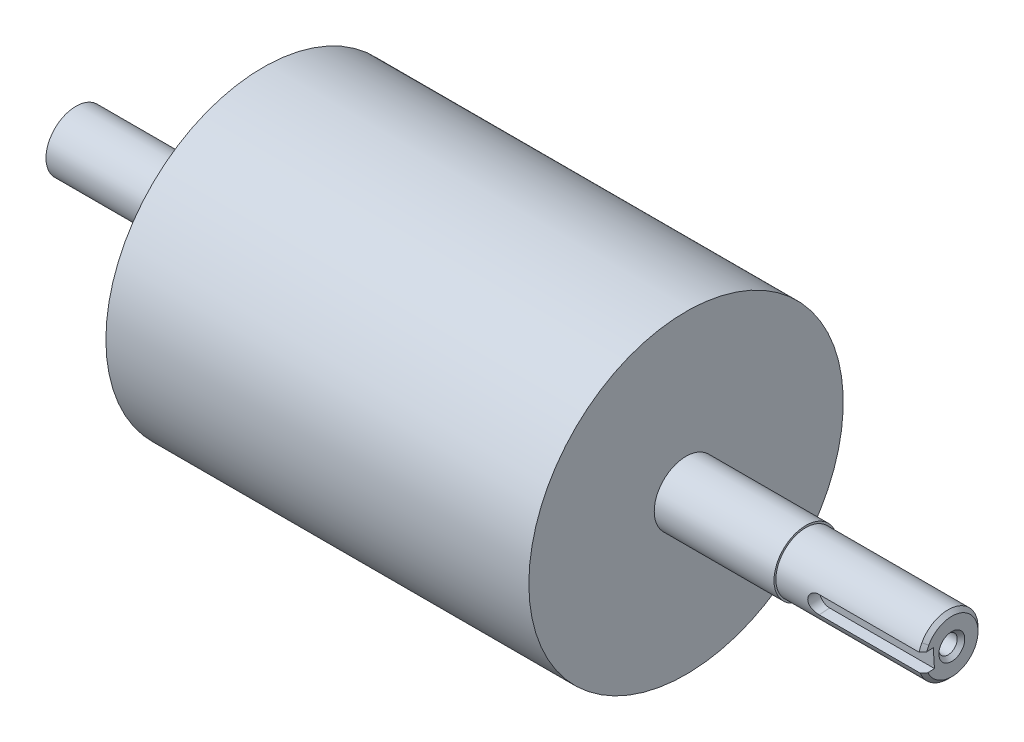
ISO-10303-21;
HEADER;
FILE_DESCRIPTION(('STEP AP214'),'2;1');
FILE_NAME('part.step','',(''),(''),'','','');
FILE_SCHEMA(('AUTOMOTIVE_DESIGN { 1 0 10303 214 1 1 1 1 }'));
ENDSEC;
DATA;
#1=APPLICATION_CONTEXT('core data for automotive mechanical design processes');
#2=APPLICATION_PROTOCOL_DEFINITION('international standard','automotive_design',2000,#1);
#3=PRODUCT_CONTEXT('',#1,'mechanical');
#4=PRODUCT('Part','Part','',(#3));
#5=PRODUCT_RELATED_PRODUCT_CATEGORY('part','',(#4));
#6=PRODUCT_DEFINITION_FORMATION('','',#4);
#7=PRODUCT_DEFINITION_CONTEXT('part definition',#1,'design');
#8=PRODUCT_DEFINITION('design','',#6,#7);
#9=PRODUCT_DEFINITION_SHAPE('','',#8);
#10=(LENGTH_UNIT() NAMED_UNIT(*) SI_UNIT(.MILLI.,.METRE.));
#11=(NAMED_UNIT(*) PLANE_ANGLE_UNIT() SI_UNIT($,.RADIAN.));
#12=(NAMED_UNIT(*) SI_UNIT($,.STERADIAN.) SOLID_ANGLE_UNIT());
#13=UNCERTAINTY_MEASURE_WITH_UNIT(LENGTH_MEASURE(1.E-05),#10,'distance_accuracy_value','');
#14=(GEOMETRIC_REPRESENTATION_CONTEXT(3) GLOBAL_UNCERTAINTY_ASSIGNED_CONTEXT((#13)) GLOBAL_UNIT_ASSIGNED_CONTEXT((#10,
#11,#12)) REPRESENTATION_CONTEXT('',''));
#15=CARTESIAN_POINT('',(0.,0.,0.));
#16=DIRECTION('',(0.,0.,1.));
#17=DIRECTION('',(1.,0.,0.));
#18=AXIS2_PLACEMENT_3D('',#15,#16,#17);
#19=CARTESIAN_POINT('',(-22.000000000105,0.,0.));
#20=DIRECTION('',(1.,0.,0.));
#21=DIRECTION('',(0.,0.,-1.));
#22=AXIS2_PLACEMENT_3D('',#19,#20,#21);
#23=CONICAL_SURFACE('',#22,2.45849999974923,1.04719755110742);
#24=CARTESIAN_POINT('',(-22.,0.,0.));
#25=DIRECTION('',(-1.,0.,0.));
#26=DIRECTION('',(0.,0.,1.));
#27=AXIS2_PLACEMENT_3D('',#24,#25,#26);
#28=CIRCLE('',#27,2.4585);
#29=CARTESIAN_POINT('',(-22.,0.,2.4585));
#30=VERTEX_POINT('',#29);
#31=EDGE_CURVE('E157',#30,#30,#28,.F.);
#32=ORIENTED_EDGE('',*,*,#31,.T.);
#33=EDGE_LOOP('',(#32));
#34=FACE_BOUND('',#33,.T.);
#35=CARTESIAN_POINT('',(-23.4194156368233,2.84216947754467E-11,-2.84217240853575E-11));
#36=VERTEX_POINT('',#35);
#37=VERTEX_LOOP('',#36);
#38=FACE_BOUND('',#37,.T.);
#39=ADVANCED_FACE('F16',(#34,#38),#23,.F.);
#40=CARTESIAN_POINT('',(-0.1,0.,0.));
#41=DIRECTION('',(-1.,0.,0.));
#42=DIRECTION('',(0.,0.,1.));
#43=AXIS2_PLACEMENT_3D('',#40,#41,#42);
#44=CYLINDRICAL_SURFACE('',#43,2.4585);
#45=CARTESIAN_POINT('',(-0.999999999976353,0.,0.));
#46=DIRECTION('',(1.,0.,0.));
#47=DIRECTION('',(0.,0.87758256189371,-0.479425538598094));
#48=AXIS2_PLACEMENT_3D('',#45,#46,#47);
#49=CIRCLE('',#48,2.45850000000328);
#50=CARTESIAN_POINT('',(-0.999999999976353,2.15753672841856,-1.17866768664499));
#51=VERTEX_POINT('',#50);
#52=EDGE_CURVE('E143',#51,#51,#49,.T.);
#53=ORIENTED_EDGE('',*,*,#52,.T.);
#54=EDGE_LOOP('',(#53));
#55=FACE_BOUND('',#54,.T.);
#56=ORIENTED_EDGE('',*,*,#31,.F.);
#57=EDGE_LOOP('',(#56));
#58=FACE_BOUND('',#57,.T.);
#59=ADVANCED_FACE('F291',(#55,#58),#44,.F.);
#60=CARTESIAN_POINT('',(-1.13686837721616E-10,0.,0.));
#61=DIRECTION('',(1.,0.,0.));
#62=DIRECTION('',(0.,0.,-1.));
#63=AXIS2_PLACEMENT_3D('',#60,#61,#62);
#64=CONICAL_SURFACE('',#63,3.45849999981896,0.785398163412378);
#65=ORIENTED_EDGE('',*,*,#52,.F.);
#66=EDGE_LOOP('',(#65));
#67=FACE_BOUND('',#66,.T.);
#68=CARTESIAN_POINT('',(7.68460815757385E-11,0.,0.));
#69=DIRECTION('',(1.,0.,0.));
#70=DIRECTION('',(0.,0.,-1.));
#71=AXIS2_PLACEMENT_3D('',#68,#69,#70);
#72=CIRCLE('',#71,3.45850000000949);
#73=CARTESIAN_POINT('',(7.68460815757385E-11,0.,-3.45850000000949));
#74=VERTEX_POINT('',#73);
#75=EDGE_CURVE('E84',#74,#74,#72,.T.);
#76=ORIENTED_EDGE('',*,*,#75,.T.);
#77=EDGE_LOOP('',(#76));
#78=FACE_BOUND('',#77,.T.);
#79=ADVANCED_FACE('F280',(#67,#78),#64,.F.);
#80=CARTESIAN_POINT('',(0.,-0.29289491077,4.7910554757));
#81=DIRECTION('',(0.,0.0610197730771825,-0.998136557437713));
#82=DIRECTION('',(0.,0.998136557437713,0.0610197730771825));
#83=AXIS2_PLACEMENT_3D('',#80,#81,#82);
#84=PLANE('',#83);
#85=DIRECTION('',(1.,0.,0.));
#86=VECTOR('',#85,1.);
#87=CARTESIAN_POINT('',(0.,2.20244648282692,4.94360490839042));
#88=LINE('',#87,#86);
#89=CARTESIAN_POINT('',(-28.,2.20244648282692,4.94360490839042));
#90=VERTEX_POINT('',#89);
#91=CARTESIAN_POINT('',(0.,2.20244648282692,4.94360490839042));
#92=VERTEX_POINT('',#91);
#93=EDGE_CURVE('E98',#90,#92,#88,.T.);
#94=ORIENTED_EDGE('',*,*,#93,.F.);
#95=CARTESIAN_POINT('',(-28.,-0.292894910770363,4.79105547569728));
#96=DIRECTION('',(0.,0.0610197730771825,-0.998136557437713));
#97=DIRECTION('',(0.,0.998136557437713,0.0610197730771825));
#98=AXIS2_PLACEMENT_3D('',#95,#96,#97);
#99=CIRCLE('',#98,2.5);
#100=CARTESIAN_POINT('',(-28.,-2.78823630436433,4.63850604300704));
#101=VERTEX_POINT('',#100);
#102=EDGE_CURVE('E114',#90,#101,#99,.F.);
#103=ORIENTED_EDGE('',*,*,#102,.T.);
#104=DIRECTION('',(1.,0.,0.));
#105=VECTOR('',#104,1.);
#106=CARTESIAN_POINT('',(-28.,-2.78823630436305,4.63850604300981));
#107=LINE('',#106,#105);
#108=CARTESIAN_POINT('',(0.,-2.78823630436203,4.63850604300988));
#109=VERTEX_POINT('',#108);
#110=EDGE_CURVE('E118',#109,#101,#107,.F.);
#111=ORIENTED_EDGE('',*,*,#110,.F.);
#112=DIRECTION('',(0.,0.998136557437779,0.0610197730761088));
#113=VECTOR('',#112,1.);
#114=CARTESIAN_POINT('',(0.,-2.78823630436,4.63850604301));
#115=LINE('',#114,#113);
#116=EDGE_CURVE('E85',#109,#92,#115,.T.);
#117=ORIENTED_EDGE('',*,*,#116,.T.);
#118=EDGE_LOOP('',(#94,#103,#111,#117));
#119=FACE_BOUND('',#118,.T.);
#120=ADVANCED_FACE('F271',(#119),#84,.F.);
#121=CARTESIAN_POINT('',(0.,0.,0.));
#122=DIRECTION('',(-1.,0.,0.));
#123=DIRECTION('',(0.,0.,1.));
#124=AXIS2_PLACEMENT_3D('',#121,#122,#123);
#125=PLANE('',#124);
#126=ORIENTED_EDGE('',*,*,#75,.F.);
#127=EDGE_LOOP('',(#126));
#128=FACE_BOUND('',#127,.T.);
#129=CARTESIAN_POINT('',(0.,0.,0.));
#130=DIRECTION('',(-1.,0.,0.));
#131=DIRECTION('',(0.,-1.,0.));
#132=AXIS2_PLACEMENT_3D('',#129,#130,#131);
#133=CIRCLE('',#132,6.99999999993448);
#134=CARTESIAN_POINT('',(2.84132697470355E-11,3.35597877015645,6.14307793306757));
#135=VERTEX_POINT('',#134);
#136=CARTESIAN_POINT('',(0.,-3.35597868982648,-6.14307797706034));
#137=VERTEX_POINT('',#136);
#138=EDGE_CURVE('E87',#135,#137,#133,.T.);
#139=ORIENTED_EDGE('',*,*,#138,.F.);
#140=CARTESIAN_POINT('',(0.,0.,0.));
#141=DIRECTION('',(-1.,0.,0.));
#142=DIRECTION('',(0.,0.,1.));
#143=AXIS2_PLACEMENT_3D('',#140,#141,#142);
#144=CIRCLE('',#143,6.99999999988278);
#145=CARTESIAN_POINT('',(0.,2.09637285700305,6.67871401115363));
#146=VERTEX_POINT('',#145);
#147=EDGE_CURVE('E19',#146,#135,#144,.T.);
#148=ORIENTED_EDGE('',*,*,#147,.F.);
#149=DIRECTION('',(0.,0.0610197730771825,-0.998136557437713));
#150=VECTOR('',#149,1.);
#151=CARTESIAN_POINT('',(0.,2.00718320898,8.13764189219));
#152=LINE('',#151,#150);
#153=EDGE_CURVE('E95',#92,#146,#152,.F.);
#154=ORIENTED_EDGE('',*,*,#153,.F.);
#155=ORIENTED_EDGE('',*,*,#116,.F.);
#156=DIRECTION('',(0.,-0.0610197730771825,0.998136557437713));
#157=VECTOR('',#156,1.);
#158=CARTESIAN_POINT('',(0.,-2.98349957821,7.83254302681));
#159=LINE('',#158,#157);
#160=CARTESIAN_POINT('',(0.,-2.89430993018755,6.37361514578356));
#161=VERTEX_POINT('',#160);
#162=EDGE_CURVE('E115',#161,#109,#159,.F.);
#163=ORIENTED_EDGE('',*,*,#162,.F.);
#164=CARTESIAN_POINT('',(0.,0.,0.));
#165=DIRECTION('',(-1.,0.,0.));
#166=DIRECTION('',(0.,0.,1.));
#167=AXIS2_PLACEMENT_3D('',#164,#165,#166);
#168=CIRCLE('',#167,6.99999999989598);
#169=EDGE_CURVE('E90',#137,#161,#168,.T.);
#170=ORIENTED_EDGE('',*,*,#169,.F.);
#171=EDGE_LOOP('',(#139,#148,#154,#155,#163,#170));
#172=FACE_BOUND('',#171,.T.);
#173=ADVANCED_FACE('F88',(#128,#172),#125,.F.);
#174=CARTESIAN_POINT('',(-0.999999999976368,0.,0.));
#175=DIRECTION('',(-1.,0.,0.));
#176=DIRECTION('',(0.,-1.,0.));
#177=AXIS2_PLACEMENT_3D('',#174,#175,#176);
#178=CONICAL_SURFACE('',#177,7.99999999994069,0.785398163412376);
#179=CARTESIAN_POINT('',(-1.00000000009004,-3.83540430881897,-7.02066049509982));
#180=CARTESIAN_POINT('',(-0.958333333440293,-3.81542824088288,-6.98409455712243));
#181=CARTESIAN_POINT('',(-0.916666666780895,-3.79545217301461,-6.94752861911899));
#182=CARTESIAN_POINT('',(-0.83333333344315,-3.75550003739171,-6.87439674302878));
#183=CARTESIAN_POINT('',(-0.791666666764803,-3.73552396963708,-6.83783080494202));
#184=CARTESIAN_POINT('',(-0.708333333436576,-3.69557183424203,-6.76469892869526));
#185=CARTESIAN_POINT('',(-0.666666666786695,-3.6755957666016,-6.72813299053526));
#186=CARTESIAN_POINT('',(-0.583333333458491,-3.63564363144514,-6.65500111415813));
#187=CARTESIAN_POINT('',(-0.541666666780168,-3.6156675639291,-6.618435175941));
#188=CARTESIAN_POINT('',(-0.458333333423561,-3.57571542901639,-6.54530329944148));
#189=CARTESIAN_POINT('',(-0.416666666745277,-3.55573936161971,-6.5087373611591));
#190=CARTESIAN_POINT('',(-0.333333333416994,-3.51578722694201,-6.43560548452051));
#191=CARTESIAN_POINT('',(-0.291666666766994,-3.495811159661,-6.39903954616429));
#192=CARTESIAN_POINT('',(-0.208333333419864,-3.45585902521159,-6.32590766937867));
#193=CARTESIAN_POINT('',(-0.166666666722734,-3.43588295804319,-6.28934173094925));
#194=CARTESIAN_POINT('',(-0.0833333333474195,-3.39593082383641,-6.21620985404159));
#195=CARTESIAN_POINT('',(-0.0416666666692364,-3.37595475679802,-6.17964391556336));
#196=CARTESIAN_POINT('',(0.,-3.35597868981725,-6.14307797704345));
#197=B_SPLINE_CURVE_WITH_KNOTS('',3,(#179,#180,#181,#182,#183,#184,#185,#186,#187,#188,#189,
#190,#191,#192,#193,#194,#195,#196),.UNSPECIFIED.,.F.,.F.,(4,2,2,2,2,2,2,2,4),(0.,
0.176776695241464,0.353553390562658,0.530330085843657,0.707106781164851,0.883883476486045,
1.06066017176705,1.23743686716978,1.41421356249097),.UNSPECIFIED.);
#198=CARTESIAN_POINT('',(-1.00000000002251,-3.83540430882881,-7.02066049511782));
#199=VERTEX_POINT('',#198);
#200=EDGE_CURVE('E92',#199,#137,#197,.T.);
#201=ORIENTED_EDGE('',*,*,#200,.F.);
#202=CARTESIAN_POINT('',(-1.,0.,0.));
#203=DIRECTION('',(-1.,0.,0.));
#204=DIRECTION('',(0.,0.,1.));
#205=AXIS2_PLACEMENT_3D('',#202,#203,#204);
#206=CIRCLE('',#205,8.);
#207=CARTESIAN_POINT('',(-1.00000000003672,3.83540430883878,7.02066049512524));
#208=VERTEX_POINT('',#207);
#209=EDGE_CURVE('E34',#208,#199,#206,.T.);
#210=ORIENTED_EDGE('',*,*,#209,.F.);
#211=DIRECTION('',(0.707106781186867,-0.339005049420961,-0.620544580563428));
#212=VECTOR('',#211,1.);
#213=CARTESIAN_POINT('',(-499000.,239236.6997421,437919.841460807));
#214=LINE('',#213,#212);
#215=EDGE_CURVE('E81',#135,#208,#214,.F.);
#216=ORIENTED_EDGE('',*,*,#215,.F.);
#217=ORIENTED_EDGE('',*,*,#138,.T.);
#218=EDGE_LOOP('',(#201,#210,#216,#217));
#219=FACE_BOUND('',#218,.T.);
#220=ADVANCED_FACE('F94',(#219),#178,.T.);
#221=CARTESIAN_POINT('',(-1.00000000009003,0.,0.));
#222=DIRECTION('',(-1.,0.,0.));
#223=DIRECTION('',(0.,0.,1.));
#224=AXIS2_PLACEMENT_3D('',#221,#222,#223);
#225=CONICAL_SURFACE('',#224,7.99999999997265,0.785398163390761);
#226=ORIENTED_EDGE('',*,*,#169,.T.);
#227=CARTESIAN_POINT('',(-1.00000000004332,-2.95905152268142,7.43263170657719));
#228=CARTESIAN_POINT('',(-0.91632185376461,-2.95367625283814,7.34470523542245));
#229=CARTESIAN_POINT('',(-0.832717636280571,-2.94829669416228,7.25670860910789));
#230=CARTESIAN_POINT('',(-0.66567524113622,-2.93752803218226,7.08055922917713));
#231=CARTESIAN_POINT('',(-0.582237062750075,-2.93213892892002,6.99240647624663));
#232=CARTESIAN_POINT('',(-0.415544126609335,-2.921350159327,6.81592818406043));
#233=CARTESIAN_POINT('',(-0.332289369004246,-2.91595049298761,6.72760264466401));
#234=CARTESIAN_POINT('',(-0.165985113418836,-2.90513936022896,6.55075854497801));
#235=CARTESIAN_POINT('',(-0.0829356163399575,-2.89972789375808,6.46223998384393));
#236=CARTESIAN_POINT('',(-4.37824904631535E-11,-2.89430993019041,6.37361514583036));
#237=B_SPLINE_CURVE_WITH_KNOTS('',3,(#227,#228,#229,#230,#231,#232,#233,#234,#235,#236),
.UNSPECIFIED.,.F.,.F.,(4,2,2,2,4),(0.,0.364496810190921,0.728992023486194,1.09348753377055,
1.45798464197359),.UNSPECIFIED.);
#238=CARTESIAN_POINT('',(-1.00000000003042,-2.95905152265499,7.43263170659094));
#239=VERTEX_POINT('',#238);
#240=EDGE_CURVE('E152',#239,#161,#237,.T.);
#241=ORIENTED_EDGE('',*,*,#240,.F.);
#242=CARTESIAN_POINT('',(-1.,0.,0.));
#243=DIRECTION('',(-1.,0.,0.));
#244=DIRECTION('',(0.,0.,1.));
#245=AXIS2_PLACEMENT_3D('',#242,#243,#244);
#246=CIRCLE('',#245,8.);
#247=EDGE_CURVE('E257',#199,#239,#246,.T.);
#248=ORIENTED_EDGE('',*,*,#247,.F.);
#249=ORIENTED_EDGE('',*,*,#200,.T.);
#250=EDGE_LOOP('',(#226,#241,#248,#249));
#251=FACE_BOUND('',#250,.T.);
#252=ADVANCED_FACE('F131',(#251),#225,.T.);
#253=CARTESIAN_POINT('',(-28.,-2.98349957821,7.83254302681));
#254=DIRECTION('',(0.,0.998136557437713,0.0610197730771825));
#255=DIRECTION('',(0.,-0.0610197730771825,0.998136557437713));
#256=AXIS2_PLACEMENT_3D('',#253,#254,#255);
#257=PLANE('',#256);
#258=DIRECTION('',(-1.,0.,0.));
#259=VECTOR('',#258,1.);
#260=CARTESIAN_POINT('',(-117.,-2.95905152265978,7.43263170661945));
#261=LINE('',#260,#259);
#262=CARTESIAN_POINT('',(-28.,-2.95905152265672,7.43263170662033));
#263=VERTEX_POINT('',#262);
#264=EDGE_CURVE('E185',#239,#263,#261,.T.);
#265=ORIENTED_EDGE('',*,*,#264,.F.);
#266=ORIENTED_EDGE('',*,*,#240,.T.);
#267=ORIENTED_EDGE('',*,*,#162,.T.);
#268=ORIENTED_EDGE('',*,*,#110,.T.);
#269=DIRECTION('',(0.,0.0610197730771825,-0.998136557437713));
#270=VECTOR('',#269,1.);
#271=CARTESIAN_POINT('',(-28.,-2.88586794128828,6.23552453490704));
#272=LINE('',#271,#270);
#273=EDGE_CURVE('E111',#101,#263,#272,.F.);
#274=ORIENTED_EDGE('',*,*,#273,.T.);
#275=EDGE_LOOP('',(#265,#266,#267,#268,#274));
#276=FACE_BOUND('',#275,.T.);
#277=ADVANCED_FACE('F128',(#276),#257,.T.);
#278=CARTESIAN_POINT('',(-28.,-0.390526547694,6.3880739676));
#279=DIRECTION('',(0.,0.0610197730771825,-0.998136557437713));
#280=DIRECTION('',(0.,0.998136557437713,0.0610197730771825));
#281=AXIS2_PLACEMENT_3D('',#278,#279,#280);
#282=CYLINDRICAL_SURFACE('',#281,2.5);
#283=ORIENTED_EDGE('',*,*,#273,.F.);
#284=ORIENTED_EDGE('',*,*,#102,.F.);
#285=DIRECTION('',(0.,0.0610197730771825,-0.998136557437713));
#286=VECTOR('',#285,1.);
#287=CARTESIAN_POINT('',(-28.,2.00718320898,8.13764189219));
#288=LINE('',#287,#286);
#289=CARTESIAN_POINT('',(-28.,2.03163126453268,7.7377305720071));
#290=VERTEX_POINT('',#289);
#291=EDGE_CURVE('E108',#290,#90,#288,.T.);
#292=ORIENTED_EDGE('',*,*,#291,.F.);
#293=CARTESIAN_POINT('',(-28.,-2.95905152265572,7.43263170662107));
#294=CARTESIAN_POINT('',(-28.0684660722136,-2.95905961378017,7.43262114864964));
#295=CARTESIAN_POINT('',(-28.1369264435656,-2.95630082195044,7.43372662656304));
#296=CARTESIAN_POINT('',(-28.2733216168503,-2.94531266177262,7.43809095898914));
#297=CARTESIAN_POINT('',(-28.3412565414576,-2.93708461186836,7.44134929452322));
#298=CARTESIAN_POINT('',(-28.475939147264,-2.91525040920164,7.44992918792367));
#299=CARTESIAN_POINT('',(-28.5426895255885,-2.90165875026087,7.45524518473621));
#300=CARTESIAN_POINT('',(-28.6747020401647,-2.86922669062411,7.46778672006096));
#301=CARTESIAN_POINT('',(-28.7399641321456,-2.85038613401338,7.47501231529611));
#302=CARTESIAN_POINT('',(-28.9327897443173,-2.78621711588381,7.49927404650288));
#303=CARTESIAN_POINT('',(-29.0575718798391,-2.73321194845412,7.51890730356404));
#304=CARTESIAN_POINT('',(-29.2962910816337,-2.60831757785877,7.56313706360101));
#305=CARTESIAN_POINT('',(-29.4102228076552,-2.53641914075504,7.58773599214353));
#306=CARTESIAN_POINT('',(-29.6279399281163,-2.37304242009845,7.64043504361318));
#307=CARTESIAN_POINT('',(-29.7313034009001,-2.28102810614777,7.66861982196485));
#308=CARTESIAN_POINT('',(-29.9211751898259,-2.08101974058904,7.72529256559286));
#309=CARTESIAN_POINT('',(-30.0076775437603,-1.97302006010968,7.75378063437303));
#310=CARTESIAN_POINT('',(-30.1632602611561,-1.74095633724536,7.80920063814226));
#311=CARTESIAN_POINT('',(-30.2318938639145,-1.61657979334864,7.83608167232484));
#312=CARTESIAN_POINT('',(-30.3467998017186,-1.35713873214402,7.88514596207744));
#313=CARTESIAN_POINT('',(-30.3930994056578,-1.22208748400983,7.90733492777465));
#314=CARTESIAN_POINT('',(-30.4514646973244,-0.986749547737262,7.93951803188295));
#315=CARTESIAN_POINT('',(-30.469629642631,-0.888159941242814,7.95117428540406));
#316=CARTESIAN_POINT('',(-30.4938991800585,-0.68915139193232,7.97088867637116));
#317=CARTESIAN_POINT('',(-30.5000042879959,-0.588732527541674,7.97894696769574));
#318=CARTESIAN_POINT('',(-30.4999941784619,-0.351614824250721,7.99343580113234));
#319=CARTESIAN_POINT('',(-30.4887276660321,-0.214784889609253,7.99825351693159));
#320=CARTESIAN_POINT('',(-30.4440506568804,0.0553478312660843,8.000952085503));
#321=CARTESIAN_POINT('',(-30.4106207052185,0.188647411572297,7.99882683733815));
#322=CARTESIAN_POINT('',(-30.3228586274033,0.447638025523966,7.98851630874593));
#323=CARTESIAN_POINT('',(-30.268564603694,0.573342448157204,7.98034205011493));
#324=CARTESIAN_POINT('',(-30.1407577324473,0.814119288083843,7.95938661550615));
#325=CARTESIAN_POINT('',(-30.0672438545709,0.92919113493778,7.94660519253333));
#326=CARTESIAN_POINT('',(-29.9006905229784,1.14892198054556,7.91786630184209));
#327=CARTESIAN_POINT('',(-29.8071641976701,1.25320161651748,7.90183027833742));
#328=CARTESIAN_POINT('',(-29.6042682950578,1.44491612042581,7.86903401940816));
#329=CARTESIAN_POINT('',(-29.4948949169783,1.53234693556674,7.85227361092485));
#330=CARTESIAN_POINT('',(-29.2600744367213,1.68989264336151,7.81990482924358));
#331=CARTESIAN_POINT('',(-29.1342935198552,1.75951931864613,7.80433579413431));
#332=CARTESIAN_POINT('',(-28.8723107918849,1.87616630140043,7.77712081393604));
#333=CARTESIAN_POINT('',(-28.7361188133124,1.92320764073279,7.76547122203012));
#334=CARTESIAN_POINT('',(-28.4994010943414,1.98242437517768,7.75052513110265));
#335=CARTESIAN_POINT('',(-28.4004854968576,2.00083335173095,7.74576962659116));
#336=CARTESIAN_POINT('',(-28.2010679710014,2.02545216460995,7.73935307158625));
#337=CARTESIAN_POINT('',(-28.1005662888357,2.03166387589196,7.73769154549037));
#338=CARTESIAN_POINT('',(-28.,2.03163126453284,7.73773057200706));
#339=B_SPLINE_CURVE_WITH_KNOTS('',3,(#293,#294,#295,#296,#297,#298,#299,#300,#301,#302,#303,
#304,#305,#306,#307,#308,#309,#310,#311,#312,#313,#314,#315,#316,#317,#318,#319,#320,#321,#322,
#323,#324,#325,#326,#327,#328,#329,#330,#331,#332,#333,#334,#335,#336,#337,#338),.UNSPECIFIED.,
.F.,.F.,(4,2,2,2,2,2,2,2,2,2,2,2,2,2,2,2,2,2,2,2,2,2,4),(0.,0.20532405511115,0.410598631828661,
0.615322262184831,0.820051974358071,1.22897204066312,1.63809233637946,2.05984532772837,
2.48174718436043,2.91335860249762,3.34444169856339,3.64646273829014,3.94847085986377,
4.35848799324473,4.76886551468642,5.17849712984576,5.58815070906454,6.00921588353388,
6.43038221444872,6.86209081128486,7.29339660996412,7.59481838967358,7.89619383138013),.UNSPECIFIED.);
#340=EDGE_CURVE('E178',#263,#290,#339,.T.);
#341=ORIENTED_EDGE('',*,*,#340,.F.);
#342=EDGE_LOOP('',(#283,#284,#292,#341));
#343=FACE_BOUND('',#342,.T.);
#344=ADVANCED_FACE('F192',(#343),#282,.F.);
#345=CARTESIAN_POINT('',(0.,2.00718320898,8.13764189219));
#346=DIRECTION('',(0.,-0.998136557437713,-0.0610197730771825));
#347=DIRECTION('',(0.,0.0610197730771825,-0.998136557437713));
#348=AXIS2_PLACEMENT_3D('',#345,#346,#347);
#349=PLANE('',#348);
#350=ORIENTED_EDGE('',*,*,#153,.T.);
#351=CARTESIAN_POINT('',(-1.00000000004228,2.03163126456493,7.73773057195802));
#352=CARTESIAN_POINT('',(-0.916321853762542,2.03700653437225,7.64980410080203));
#353=CARTESIAN_POINT('',(-0.832717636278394,2.04238609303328,7.56180747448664));
#354=CARTESIAN_POINT('',(-0.665675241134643,2.05315475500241,7.38565809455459));
#355=CARTESIAN_POINT('',(-0.582237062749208,2.05854385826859,7.29750534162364));
#356=CARTESIAN_POINT('',(-0.415544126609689,2.06933262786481,7.12102704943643));
#357=CARTESIAN_POINT('',(-0.33228936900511,2.07473229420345,7.03270151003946));
#358=CARTESIAN_POINT('',(-0.165985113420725,2.0855434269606,6.85585741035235));
#359=CARTESIAN_POINT('',(-0.0829356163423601,2.09095489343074,6.76733884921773));
#360=CARTESIAN_POINT('',(-4.68031748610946E-11,2.096372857,6.67871401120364));
#361=B_SPLINE_CURVE_WITH_KNOTS('',3,(#351,#352,#353,#354,#355,#356,#357,#358,#359,#360),
.UNSPECIFIED.,.F.,.F.,(4,2,2,2,4),(0.,0.364496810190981,0.728992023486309,1.09348753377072,
1.45798464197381),.UNSPECIFIED.);
#362=CARTESIAN_POINT('',(-1.00000000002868,2.03163126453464,7.73773057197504));
#363=VERTEX_POINT('',#362);
#364=EDGE_CURVE('E83',#363,#146,#361,.T.);
#365=ORIENTED_EDGE('',*,*,#364,.F.);
#366=DIRECTION('',(-1.,0.,0.));
#367=VECTOR('',#366,1.);
#368=CARTESIAN_POINT('',(-117.,2.03163126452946,7.73773057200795));
#369=LINE('',#368,#367);
#370=EDGE_CURVE('E184',#290,#363,#369,.F.);
#371=ORIENTED_EDGE('',*,*,#370,.F.);
#372=ORIENTED_EDGE('',*,*,#291,.T.);
#373=ORIENTED_EDGE('',*,*,#93,.T.);
#374=EDGE_LOOP('',(#350,#365,#371,#372,#373));
#375=FACE_BOUND('',#374,.T.);
#376=ADVANCED_FACE('F203',(#375),#349,.T.);
#377=CARTESIAN_POINT('',(-1.00000000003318,0.,0.));
#378=DIRECTION('',(-1.,0.,0.));
#379=DIRECTION('',(0.,0.,1.));
#380=AXIS2_PLACEMENT_3D('',#377,#378,#379);
#381=CONICAL_SURFACE('',#380,7.99999999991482,0.785398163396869);
#382=CARTESIAN_POINT('',(-1.,0.,0.));
#383=DIRECTION('',(-1.,0.,0.));
#384=DIRECTION('',(0.,0.,1.));
#385=AXIS2_PLACEMENT_3D('',#382,#383,#384);
#386=CIRCLE('',#385,8.);
#387=EDGE_CURVE('E177',#363,#208,#386,.T.);
#388=ORIENTED_EDGE('',*,*,#387,.F.);
#389=ORIENTED_EDGE('',*,*,#364,.T.);
#390=ORIENTED_EDGE('',*,*,#147,.T.);
#391=ORIENTED_EDGE('',*,*,#215,.T.);
#392=EDGE_LOOP('',(#388,#389,#390,#391));
#393=FACE_BOUND('',#392,.T.);
#394=ADVANCED_FACE('F80',(#393),#381,.T.);
#395=CARTESIAN_POINT('',(-117.,0.,0.));
#396=DIRECTION('',(-1.,0.,0.));
#397=DIRECTION('',(0.,0.,1.));
#398=AXIS2_PLACEMENT_3D('',#395,#396,#397);
#399=CYLINDRICAL_SURFACE('',#398,8.);
#400=CARTESIAN_POINT('',(-39.,0.,0.));
#401=DIRECTION('',(-1.,0.,0.));
#402=DIRECTION('',(0.,0.,1.));
#403=AXIS2_PLACEMENT_3D('',#400,#401,#402);
#404=CIRCLE('',#403,8.);
#405=CARTESIAN_POINT('',(-39.,0.,8.));
#406=VERTEX_POINT('',#405);
#407=EDGE_CURVE('E174',#406,#406,#404,.F.);
#408=ORIENTED_EDGE('',*,*,#407,.T.);
#409=EDGE_LOOP('',(#408));
#410=FACE_BOUND('',#409,.T.);
#411=ORIENTED_EDGE('',*,*,#387,.T.);
#412=ORIENTED_EDGE('',*,*,#209,.T.);
#413=ORIENTED_EDGE('',*,*,#247,.T.);
#414=ORIENTED_EDGE('',*,*,#264,.T.);
#415=ORIENTED_EDGE('',*,*,#340,.T.);
#416=ORIENTED_EDGE('',*,*,#370,.T.);
#417=EDGE_LOOP('',(#411,#412,#413,#414,#415,#416));
#418=FACE_BOUND('',#417,.T.);
#419=ADVANCED_FACE('F194',(#410,#418),#399,.T.);
#420=CARTESIAN_POINT('',(-234.,0.,8.));
#421=DIRECTION('',(-1.,0.,0.));
#422=DIRECTION('',(0.,0.,1.));
#423=AXIS2_PLACEMENT_3D('',#420,#421,#422);
#424=PLANE('',#423);
#425=CARTESIAN_POINT('',(-234.,0.,0.));
#426=DIRECTION('',(-1.,0.,0.));
#427=DIRECTION('',(0.,0.,1.));
#428=AXIS2_PLACEMENT_3D('',#425,#426,#427);
#429=CIRCLE('',#428,8.);
#430=CARTESIAN_POINT('',(-234.,0.,8.));
#431=VERTEX_POINT('',#430);
#432=EDGE_CURVE('E171',#431,#431,#429,.F.);
#433=ORIENTED_EDGE('',*,*,#432,.F.);
#434=EDGE_LOOP('',(#433));
#435=FACE_BOUND('',#434,.T.);
#436=ADVANCED_FACE('F198',(#435),#424,.T.);
#437=CARTESIAN_POINT('',(-39.,0.,8.));
#438=DIRECTION('',(-1.,0.,0.));
#439=DIRECTION('',(0.,0.,1.));
#440=AXIS2_PLACEMENT_3D('',#437,#438,#439);
#441=PLANE('',#440);
#442=ORIENTED_EDGE('',*,*,#407,.F.);
#443=EDGE_LOOP('',(#442));
#444=FACE_BOUND('',#443,.T.);
#445=CARTESIAN_POINT('',(-39.,0.,0.));
#446=DIRECTION('',(-1.,0.,0.));
#447=DIRECTION('',(0.,0.,1.));
#448=AXIS2_PLACEMENT_3D('',#445,#446,#447);
#449=CIRCLE('',#448,8.5);
#450=CARTESIAN_POINT('',(-39.,0.,8.5));
#451=VERTEX_POINT('',#450);
#452=EDGE_CURVE('E168',#451,#451,#449,.T.);
#453=ORIENTED_EDGE('',*,*,#452,.F.);
#454=EDGE_LOOP('',(#453));
#455=FACE_BOUND('',#454,.T.);
#456=ADVANCED_FACE('F234',(#444,#455),#441,.F.);
#457=CARTESIAN_POINT('',(-117.,0.,0.));
#458=DIRECTION('',(-1.,0.,0.));
#459=DIRECTION('',(0.,0.,1.));
#460=AXIS2_PLACEMENT_3D('',#457,#458,#459);
#461=CYLINDRICAL_SURFACE('',#460,8.);
#462=CARTESIAN_POINT('',(-184.,0.,0.));
#463=DIRECTION('',(-1.,0.,0.));
#464=DIRECTION('',(0.,0.,1.));
#465=AXIS2_PLACEMENT_3D('',#462,#463,#464);
#466=CIRCLE('',#465,8.);
#467=CARTESIAN_POINT('',(-184.,0.,8.));
#468=VERTEX_POINT('',#467);
#469=EDGE_CURVE('E165',#468,#468,#466,.F.);
#470=ORIENTED_EDGE('',*,*,#469,.F.);
#471=EDGE_LOOP('',(#470));
#472=FACE_BOUND('',#471,.T.);
#473=ORIENTED_EDGE('',*,*,#432,.T.);
#474=EDGE_LOOP('',(#473));
#475=FACE_BOUND('',#474,.T.);
#476=ADVANCED_FACE('F231',(#472,#475),#461,.T.);
#477=CARTESIAN_POINT('',(-117.,0.,0.));
#478=DIRECTION('',(-1.,0.,0.));
#479=DIRECTION('',(0.,0.,1.));
#480=AXIS2_PLACEMENT_3D('',#477,#478,#479);
#481=CYLINDRICAL_SURFACE('',#480,8.5);
#482=ORIENTED_EDGE('',*,*,#452,.T.);
#483=EDGE_LOOP('',(#482));
#484=FACE_BOUND('',#483,.T.);
#485=CARTESIAN_POINT('',(-71.,0.,0.));
#486=DIRECTION('',(-1.,0.,0.));
#487=DIRECTION('',(0.,0.,1.));
#488=AXIS2_PLACEMENT_3D('',#485,#486,#487);
#489=CIRCLE('',#488,8.5);
#490=CARTESIAN_POINT('',(-71.,0.,8.5));
#491=VERTEX_POINT('',#490);
#492=EDGE_CURVE('E162',#491,#491,#489,.F.);
#493=ORIENTED_EDGE('',*,*,#492,.T.);
#494=EDGE_LOOP('',(#493));
#495=FACE_BOUND('',#494,.T.);
#496=ADVANCED_FACE('F227',(#484,#495),#481,.T.);
#497=CARTESIAN_POINT('',(-184.,0.,42.));
#498=DIRECTION('',(-1.,0.,0.));
#499=DIRECTION('',(0.,0.,1.));
#500=AXIS2_PLACEMENT_3D('',#497,#498,#499);
#501=PLANE('',#500);
#502=ORIENTED_EDGE('',*,*,#469,.T.);
#503=EDGE_LOOP('',(#502));
#504=FACE_BOUND('',#503,.T.);
#505=CARTESIAN_POINT('',(-184.,0.,0.));
#506=DIRECTION('',(-1.,0.,0.));
#507=DIRECTION('',(0.,0.,1.));
#508=AXIS2_PLACEMENT_3D('',#505,#506,#507);
#509=CIRCLE('',#508,42.);
#510=CARTESIAN_POINT('',(-184.,0.,42.));
#511=VERTEX_POINT('',#510);
#512=EDGE_CURVE('E25',#511,#511,#509,.F.);
#513=ORIENTED_EDGE('',*,*,#512,.F.);
#514=EDGE_LOOP('',(#513));
#515=FACE_BOUND('',#514,.T.);
#516=ADVANCED_FACE('F220',(#504,#515),#501,.T.);
#517=CARTESIAN_POINT('',(-71.,0.,8.5));
#518=DIRECTION('',(-1.,0.,0.));
#519=DIRECTION('',(0.,0.,1.));
#520=AXIS2_PLACEMENT_3D('',#517,#518,#519);
#521=PLANE('',#520);
#522=ORIENTED_EDGE('',*,*,#492,.F.);
#523=EDGE_LOOP('',(#522));
#524=FACE_BOUND('',#523,.T.);
#525=CARTESIAN_POINT('',(-71.,0.,0.));
#526=DIRECTION('',(-1.,0.,0.));
#527=DIRECTION('',(0.,0.,1.));
#528=AXIS2_PLACEMENT_3D('',#525,#526,#527);
#529=CIRCLE('',#528,42.);
#530=CARTESIAN_POINT('',(-71.,0.,42.));
#531=VERTEX_POINT('',#530);
#532=EDGE_CURVE('E11',#531,#531,#529,.T.);
#533=ORIENTED_EDGE('',*,*,#532,.F.);
#534=EDGE_LOOP('',(#533));
#535=FACE_BOUND('',#534,.T.);
#536=ADVANCED_FACE('F214',(#524,#535),#521,.F.);
#537=CARTESIAN_POINT('',(-117.,0.,0.));
#538=DIRECTION('',(-1.,0.,0.));
#539=DIRECTION('',(0.,0.,1.));
#540=AXIS2_PLACEMENT_3D('',#537,#538,#539);
#541=CYLINDRICAL_SURFACE('',#540,42.);
#542=ORIENTED_EDGE('',*,*,#532,.T.);
#543=EDGE_LOOP('',(#542));
#544=FACE_BOUND('',#543,.T.);
#545=ORIENTED_EDGE('',*,*,#512,.T.);
#546=EDGE_LOOP('',(#545));
#547=FACE_BOUND('',#546,.T.);
#548=ADVANCED_FACE('F212',(#544,#547),#541,.T.);
#549=CLOSED_SHELL('',(#39,#59,#79,#120,#173,#220,#252,#277,#344,#376,#394,#419,#436,#456,#476,
#496,#516,#536,#548));
#550=MANIFOLD_SOLID_BREP('B1',#549);
#551=ADVANCED_BREP_SHAPE_REPRESENTATION('',(#18,#550),#14);
#552=SHAPE_DEFINITION_REPRESENTATION(#9,#551);
ENDSEC;
END-ISO-10303-21;
